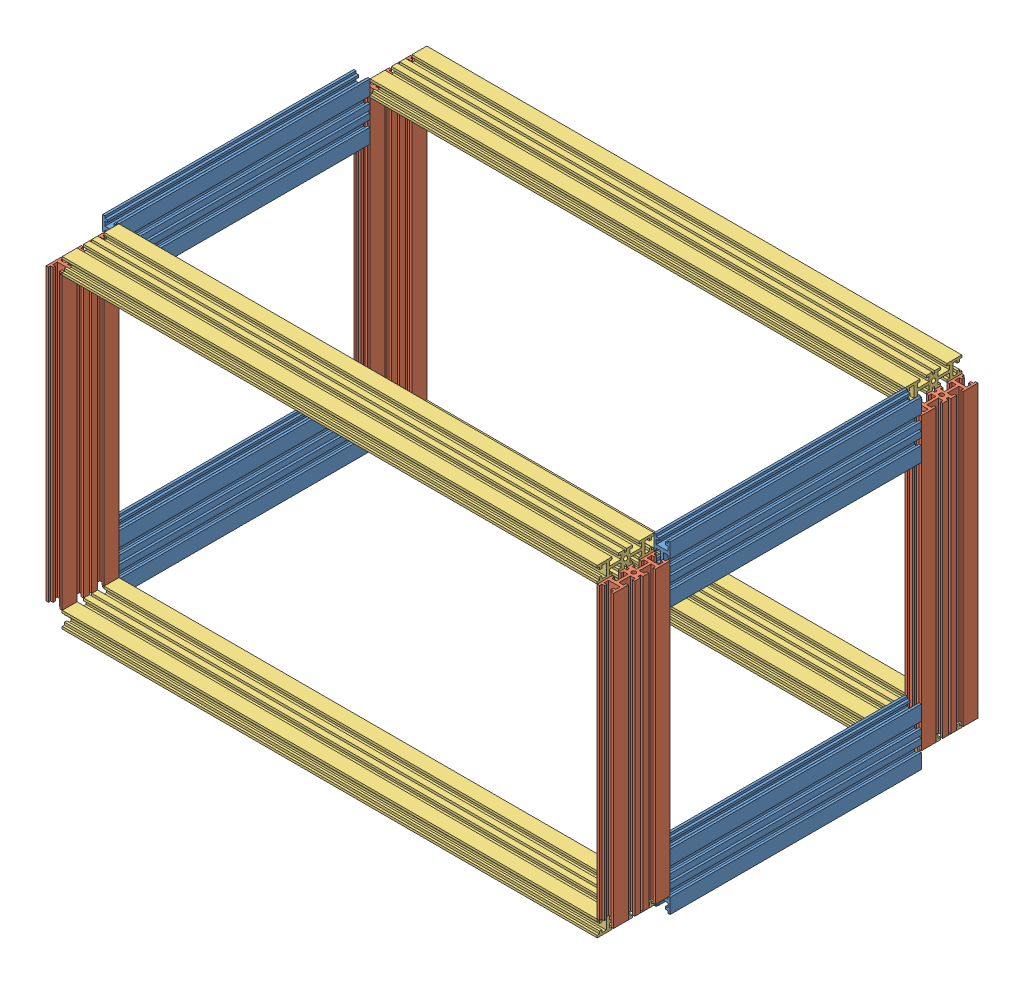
SolidWorks assembly Blades ASM.SLDASM, configuration Default (file format 9000). Lengths in mm.
Overall size (445 253 285.9).
12 component instances, 3 part files, 34 mates.
Components (placement in the parent):
- Blade1-1: Blade1.SLDPRT [Default] at (114.7807 102.2962 48.6134) x (0 1 0) z (0 0 -1) size (44.45 12.7 197)
- Blade2-1: Blade2.SLDPRT [Default] at (114.7807 111.8212 -170.6116) x (0 0 -1) z (0 -1 0) size (44.45 12.7 227.6)
- Blade3-2: Blade3.SLDPRT [Default] at (121.1307 -122.1288 -170.6116) x (0 0 -1) z (1 0 0) size (44.45 12.7 419.6)
- Blade3-6: Blade3.SLDPRT [Default] at (121.1307 118.1712 -170.6116) x (0 0 -1) z (1 0 0) size (44.45 12.7 419.6)
- Blade3-7: Blade3.SLDPRT [Default] at (121.1307 -122.1288 70.8384) x (0 0 -1) z (1 0 0) size (44.45 12.7 419.6)
- Blade3-8: Blade3.SLDPRT [Default] at (121.1307 118.1712 70.8384) x (0 0 -1) z (1 0 0) size (44.45 12.7 419.6)
- Blade1-2: Blade1.SLDPRT [Default] at (114.7807 -106.2538 48.6134) x (0 1 0) z (0 0 -1) size (44.45 12.7 197)
- Blade1-3: Blade1.SLDPRT [Default] at (547.0807 -106.2538 48.6134) x (0 1 0) z (0 0 -1) size (44.45 12.7 197)
- Blade1-4: Blade1.SLDPRT [Default] at (547.0807 102.2962 48.6134) x (0 1 0) z (0 0 -1) size (44.45 12.7 197)
- Blade2-2: Blade2.SLDPRT [Default] at (547.0807 111.8212 -170.6116) x (0 0 -1) z (0 -1 0) size (44.45 12.7 227.6)
- Blade2-3: Blade2.SLDPRT [Default] at (114.7807 111.8212 70.8384) x (0 0 -1) z (0 -1 0) size (44.45 12.7 227.6)
- Blade2-4: Blade2.SLDPRT [Default] at (547.0807 111.8212 70.8384) x (0 0 -1) z (0 -1 0) size (44.45 12.7 227.6)
Mates (geometry in assembly coordinates):
- Coincident1: coincident aligned: plane of Blade1-1 through (114.7807 102.2962 -148.3866) normal (0 0 -1); plane of Blade1-4 through (547.0807 102.2962 -148.3866) normal (0 0 -1)
- Coincident2: coincident aligned: plane of Blade1-1 through (114.7807 102.2962 -148.3866) normal (0 0 -1); plane of Blade1-3 through (547.0807 -106.2538 -148.3866) normal (0 0 -1)
- Coincident3: coincident aligned: plane of Blade1-1 through (114.7807 102.2962 -148.3866) normal (0 0 -1); plane of Blade1-2 through (114.7807 -106.2538 -148.3866) normal (0 0 -1)
- Coincident4: coincident aligned: plane of Blade1-1 through (110.2307 124.5212 -148.3866) normal (0 1 0); plane of Blade1-4 through (542.5307 124.5212 -148.3866) normal (0 1 0)
- Coincident5: coincident aligned: plane of Blade1-2 through (121.1307 -128.4788 -148.3866) normal (0 -1 0); plane of Blade1-3 through (553.4307 -128.4788 -148.3866) normal (0 -1 0)
- Coincident6: coincident aligned: plane of Blade1-1 through (108.4307 80.0712 -148.3866) normal (-1 0 0); plane of Blade1-2 through (108.4307 -84.0288 -148.3866) normal (-1 0 0)
- Coincident7: coincident aligned: plane of Blade1-3 through (553.4307 -95.6538 -148.3866) normal (1 0 0); plane of Blade1-4 through (553.4307 91.6962 -148.3866) normal (1 0 0)
- Coincident8: coincident aligned: plane of Blade3-6 through (540.7307 124.5212 -181.2116) normal (0 1 0); plane of Blade3-8 through (540.7307 124.5212 60.2384) normal (0 1 0)
- Coincident11: coincident aligned: plane of Blade3-2 through (540.7307 -115.7788 -181.2116) normal (0 1 0); plane of Blade3-7 through (540.7307 -115.7788 60.2384) normal (0 1 0)
- Coincident12: coincident aligned: plane of Blade3-6 through (121.1307 118.1712 -170.6116) normal (-1 0 0); plane of Blade3-8 through (121.1307 118.1712 70.8384) normal (-1 0 0)
- Coincident13: coincident aligned: plane of Blade3-2 through (121.1307 -122.1288 -170.6116) normal (-1 0 0); plane of Blade3-6 through (121.1307 118.1712 -170.6116) normal (-1 0 0)
- Coincident14: coincident aligned: plane of Blade3-6 through (121.1307 118.1712 -170.6116) normal (-1 0 0); plane of Blade3-7 through (121.1307 -122.1288 70.8384) normal (-1 0 0)
- Coincident15: coincident aligned: plane of Blade2-1 through (108.4307 -115.7788 -148.3866) normal (-1 0 0); plane of Blade2-3 through (108.4307 -115.7788 93.0634) normal (-1 0 0)
- Coincident16: coincident aligned: plane of Blade2-1 through (114.7807 111.8212 -170.6116) normal (0 1 0); plane of Blade2-3 through (114.7807 111.8212 70.8384) normal (0 1 0)
- Coincident17: coincident aligned: plane of Blade2-1 through (114.7807 111.8212 -170.6116) normal (0 1 0); plane of Blade2-2 through (547.0807 111.8212 -170.6116) normal (0 1 0)
- Coincident18: coincident aligned: plane of Blade2-1 through (114.7807 111.8212 -170.6116) normal (0 1 0); plane of Blade2-4 through (547.0807 111.8212 70.8384) normal (0 1 0)
- Coincident19: coincident aligned: plane of Blade2-2 through (553.4307 -115.7788 -181.2116) normal (1 0 0); plane of Blade2-4 through (553.4307 -115.7788 60.2384) normal (1 0 0)
- Coincident20: coincident aligned: plane of Blade2-3 through (108.4307 -115.7788 93.0634) normal (0 0 1); plane of Blade2-4 through (540.7307 -115.7788 93.0634) normal (0 0 1)
- Coincident21: coincident aligned: plane of Blade2-1 through (119.3307 -115.7788 -192.8366) normal (0 0 -1); plane of Blade2-2 through (551.6307 -115.7788 -192.8366) normal (0 0 -1)
- Coincident22: coincident aligned: plane of Blade3-2 through (540.7307 -117.5788 -192.8366) normal (0 0 -1); plane of Blade3-6 through (540.7307 122.7212 -192.8366) normal (0 0 -1)
- Coincident23: coincident aligned: plane of Blade3-7 through (540.7307 -115.7788 93.0634) normal (0 0 1); plane of Blade3-8 through (540.7307 124.5212 93.0634) normal (0 0 1)
- Coincident24: coincident anti-aligned: plane of Blade3-6 through (540.7307 111.8212 -192.8366) normal (0 -1 0); plane of Blade2-3 through (114.7807 111.8212 70.8384) normal (0 1 0)
- Coincident25: coincident anti-aligned: plane of Blade2-1 through (121.1307 -115.7788 -160.0116) normal (1 0 0); plane of Blade3-6 through (121.1307 118.1712 -170.6116) normal (-1 0 0)
- Coincident26: coincident anti-aligned: plane of Blade3-6 through (540.7307 118.1712 -170.6116) normal (1 0 0); plane of Blade2-2 through (540.7307 -115.7788 -192.8366) normal (-1 0 0)
- Coincident27: coincident anti-aligned: plane of Blade2-1 through (121.1307 -115.7788 -160.0116) normal (1 0 0); plane of Blade3-2 through (121.1307 -122.1288 -170.6116) normal (-1 0 0)
- Coincident28: coincident anti-aligned: plane of Blade2-1 through (114.7807 -115.7788 -170.6116) normal (0 -1 0); plane of Blade3-2 through (540.7307 -115.7788 -160.0116) normal (0 1 0)
- Coincident29: coincident aligned: plane of Blade3-8 through (540.7307 111.8212 93.0634) normal (0 0 1); plane of Blade2-3 through (121.1307 -115.7788 93.0634) normal (0 0 1)
- Coincident30: coincident aligned: plane of Blade3-6 through (540.7307 122.7212 -192.8366) normal (0 0 -1); plane of Blade2-2 through (551.6307 -115.7788 -192.8366) normal (0 0 -1)
- Coincident31: coincident aligned: plane of Blade1-1 through (108.4307 124.5212 -148.3866) normal (-1 0 0); plane of Blade2-1 through (108.4307 -115.7788 -192.8366) normal (-1 0 0)
- Coincident32: coincident aligned: plane of Blade1-1 through (110.2307 124.5212 -148.3866) normal (0 1 0); plane of Blade3-6 through (540.7307 124.5212 -160.0116) normal (0 1 0)
- Coincident33: coincident anti-aligned: plane of Blade1-1 through (114.7807 102.2962 -148.3866) normal (0 0 -1); plane of Blade2-1 through (108.4307 -115.7788 -148.3866) normal (0 0 1)
- Coincident34: coincident aligned: plane of Blade1-4 through (553.4307 112.8962 -148.3866) normal (1 0 0); plane of Blade2-2 through (553.4307 -115.7788 -160.0116) normal (1 0 0)
- Coincident35: coincident aligned: plane of Blade3-2 through (540.7307 -128.4788 -165.1116) normal (0 -1 0); plane of Blade1-2 through (108.4307 -128.4788 -148.3866) normal (0 -1 0)
- Coincident36: coincident anti-aligned: plane of Blade1-1 through (114.7807 102.2962 48.6134) normal (0 0 1); plane of Blade2-3 through (119.3307 -115.7788 48.6134) normal (0 0 -1)
